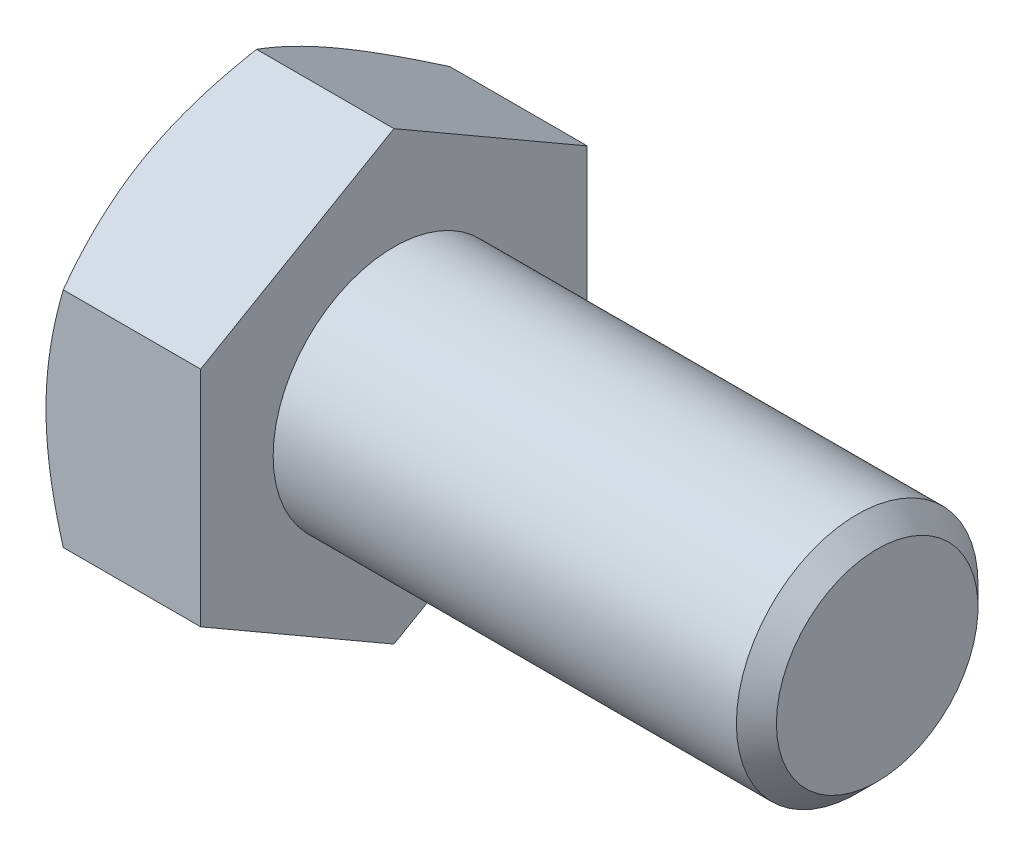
from build123d import *

# Parameters (mm, degrees)
BASEHEAD_DEPTH = 6.4


with BuildPart() as part:
    # Sketch1 → BaseHead (new body)
    with BuildSketch(Plane(origin=(0, 0, 0), x_dir=(0, 0, -1), z_dir=(1, 0, 0))):
        Polygon((8, 4.618802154), (8, -4.618802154), (0, -9.237604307), (-8, -4.618802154), (-8, 4.618802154), (0, 9.237604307), align=None)
    extrude(amount=BASEHEAD_DEPTH)

    # BodySke → BaseBody (revolve)
    with BuildSketch(Plane.XY, mode=Mode.PRIVATE) as basebody_sk:
        Polygon((0, 0), (26.4, 0), (26.4, 4.172), (25.572, 5), (0, 5), align=None)
    revolve(basebody_sk.sketch.rotate(Axis((0, 0, 0), (1, 0, 0)), 90), axis=Axis((0, 0, 0), (1, 0, 0)))

    # Sketch3 → HeadChamfer (revolve, cut)
    with BuildSketch(Plane.XY):
        Polygon((0, 8), (3.601282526, 14.237604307), (3.601282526, 19.237604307), (-10, 19.237604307), (-10, 8), align=None)
    revolve(axis=Axis((0, 0, 0), (1, 0, 0)), mode=Mode.SUBTRACT)


solid = part.part
